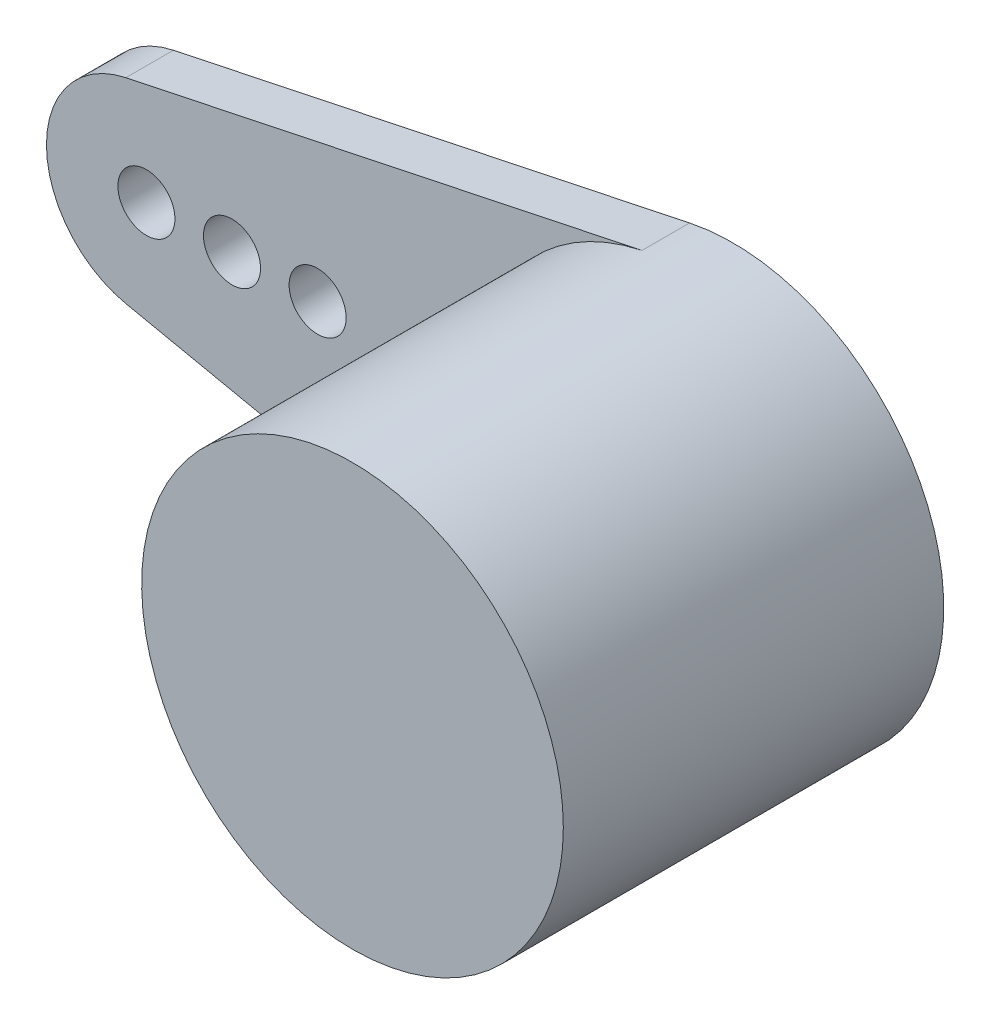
ISO-10303-21;
HEADER;
FILE_DESCRIPTION(('STEP AP214'),'2;1');
FILE_NAME('part.step','',(''),(''),'','','');
FILE_SCHEMA(('AUTOMOTIVE_DESIGN { 1 0 10303 214 1 1 1 1 }'));
ENDSEC;
DATA;
#1=APPLICATION_CONTEXT('core data for automotive mechanical design processes');
#2=APPLICATION_PROTOCOL_DEFINITION('international standard','automotive_design',2000,#1);
#3=PRODUCT_CONTEXT('',#1,'mechanical');
#4=PRODUCT('Part','Part','',(#3));
#5=PRODUCT_RELATED_PRODUCT_CATEGORY('part','',(#4));
#6=PRODUCT_DEFINITION_FORMATION('','',#4);
#7=PRODUCT_DEFINITION_CONTEXT('part definition',#1,'design');
#8=PRODUCT_DEFINITION('design','',#6,#7);
#9=PRODUCT_DEFINITION_SHAPE('','',#8);
#10=(LENGTH_UNIT() NAMED_UNIT(*) SI_UNIT(.MILLI.,.METRE.));
#11=(NAMED_UNIT(*) PLANE_ANGLE_UNIT() SI_UNIT($,.RADIAN.));
#12=(NAMED_UNIT(*) SI_UNIT($,.STERADIAN.) SOLID_ANGLE_UNIT());
#13=UNCERTAINTY_MEASURE_WITH_UNIT(LENGTH_MEASURE(1.E-05),#10,'distance_accuracy_value','');
#14=(GEOMETRIC_REPRESENTATION_CONTEXT(3) GLOBAL_UNCERTAINTY_ASSIGNED_CONTEXT((#13)) GLOBAL_UNIT_ASSIGNED_CONTEXT((#10,
#11,#12)) REPRESENTATION_CONTEXT('',''));
#15=CARTESIAN_POINT('',(0.,0.,0.));
#16=DIRECTION('',(0.,0.,1.));
#17=DIRECTION('',(1.,0.,0.));
#18=AXIS2_PLACEMENT_3D('',#15,#16,#17);
#19=CARTESIAN_POINT('',(0.,0.,12.));
#20=DIRECTION('',(0.,0.,-1.));
#21=DIRECTION('',(-1.,0.,0.));
#22=AXIS2_PLACEMENT_3D('',#19,#20,#21);
#23=CYLINDRICAL_SURFACE('',#22,6.65);
#24=CARTESIAN_POINT('',(0.,0.,12.));
#25=DIRECTION('',(0.,0.,1.));
#26=DIRECTION('',(1.,0.,0.));
#27=AXIS2_PLACEMENT_3D('',#24,#25,#26);
#28=CIRCLE('',#27,6.65);
#29=CARTESIAN_POINT('',(6.65,0.,12.));
#30=VERTEX_POINT('',#29);
#31=EDGE_CURVE('E41',#30,#30,#28,.T.);
#32=ORIENTED_EDGE('',*,*,#31,.F.);
#33=EDGE_LOOP('',(#32));
#34=FACE_BOUND('',#33,.T.);
#35=CARTESIAN_POINT('',(0.,0.,1.5));
#36=DIRECTION('',(0.,0.,-1.));
#37=DIRECTION('',(-1.,0.,0.));
#38=AXIS2_PLACEMENT_3D('',#35,#36,#37);
#39=CIRCLE('',#38,6.65);
#40=CARTESIAN_POINT('',(-1.36769722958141,-6.50783407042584,1.5));
#41=VERTEX_POINT('',#40);
#42=CARTESIAN_POINT('',(-1.36769722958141,6.50783407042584,1.5));
#43=VERTEX_POINT('',#42);
#44=EDGE_CURVE('E11',#41,#43,#39,.T.);
#45=ORIENTED_EDGE('',*,*,#44,.F.);
#46=DIRECTION('',(0.,0.,-1.));
#47=VECTOR('',#46,1.);
#48=CARTESIAN_POINT('',(-1.36769722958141,-6.50783407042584,1.5));
#49=LINE('',#48,#47);
#50=CARTESIAN_POINT('',(-1.36769722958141,-6.50783407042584,0.));
#51=VERTEX_POINT('',#50);
#52=EDGE_CURVE('E83',#41,#51,#49,.T.);
#53=ORIENTED_EDGE('',*,*,#52,.T.);
#54=CARTESIAN_POINT('',(0.,0.,0.));
#55=DIRECTION('',(0.,0.,1.));
#56=DIRECTION('',(1.,0.,0.));
#57=AXIS2_PLACEMENT_3D('',#54,#55,#56);
#58=CIRCLE('',#57,6.65);
#59=CARTESIAN_POINT('',(-1.36769722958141,6.50783407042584,0.));
#60=VERTEX_POINT('',#59);
#61=EDGE_CURVE('E107',#51,#60,#58,.T.);
#62=ORIENTED_EDGE('',*,*,#61,.T.);
#63=DIRECTION('',(0.,0.,-1.));
#64=VECTOR('',#63,1.);
#65=CARTESIAN_POINT('',(-1.36769722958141,6.50783407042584,1.5));
#66=LINE('',#65,#64);
#67=EDGE_CURVE('E48',#43,#60,#66,.T.);
#68=ORIENTED_EDGE('',*,*,#67,.F.);
#69=EDGE_LOOP('',(#45,#53,#62,#68));
#70=FACE_BOUND('',#69,.T.);
#71=ADVANCED_FACE('F34',(#34,#70),#23,.T.);
#72=CARTESIAN_POINT('',(0.,0.,12.));
#73=DIRECTION('',(0.,0.,1.));
#74=DIRECTION('',(1.,0.,0.));
#75=AXIS2_PLACEMENT_3D('',#72,#73,#74);
#76=PLANE('',#75);
#77=ORIENTED_EDGE('',*,*,#31,.T.);
#78=EDGE_LOOP('',(#77));
#79=FACE_BOUND('',#78,.T.);
#80=ADVANCED_FACE('F118',(#79),#76,.T.);
#81=CARTESIAN_POINT('',(0.,0.,0.));
#82=DIRECTION('',(0.,0.,1.));
#83=DIRECTION('',(1.,0.,0.));
#84=AXIS2_PLACEMENT_3D('',#81,#82,#83);
#85=PLANE('',#84);
#86=ORIENTED_EDGE('',*,*,#61,.F.);
#87=DIRECTION('',(-0.97862166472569,0.205668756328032,0.));
#88=VECTOR('',#87,1.);
#89=CARTESIAN_POINT('',(-17.6486033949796,-3.08621175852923,0.));
#90=LINE('',#89,#88);
#91=CARTESIAN_POINT('',(-17.6486033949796,-3.08621175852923,0.));
#92=VERTEX_POINT('',#91);
#93=EDGE_CURVE('E102',#51,#92,#90,.T.);
#94=ORIENTED_EDGE('',*,*,#93,.T.);
#95=CARTESIAN_POINT('',(-17.,0.,0.));
#96=DIRECTION('',(0.,0.,-1.));
#97=DIRECTION('',(-1.,0.,0.));
#98=AXIS2_PLACEMENT_3D('',#95,#96,#97);
#99=CIRCLE('',#98,3.15363114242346);
#100=CARTESIAN_POINT('',(-17.6486033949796,3.08621175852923,0.));
#101=VERTEX_POINT('',#100);
#102=EDGE_CURVE('E77',#92,#101,#99,.T.);
#103=ORIENTED_EDGE('',*,*,#102,.T.);
#104=DIRECTION('',(0.97862166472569,0.205668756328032,0.));
#105=VECTOR('',#104,1.);
#106=CARTESIAN_POINT('',(-1.36769722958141,6.50783407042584,0.));
#107=LINE('',#106,#105);
#108=EDGE_CURVE('E93',#101,#60,#107,.T.);
#109=ORIENTED_EDGE('',*,*,#108,.T.);
#110=EDGE_LOOP('',(#86,#94,#103,#109));
#111=FACE_BOUND('',#110,.T.);
#112=CARTESIAN_POINT('',(-11.6,0.,0.));
#113=DIRECTION('',(0.,0.,-1.));
#114=DIRECTION('',(-1.,0.,0.));
#115=AXIS2_PLACEMENT_3D('',#112,#113,#114);
#116=CIRCLE('',#115,0.9);
#117=CARTESIAN_POINT('',(-12.5,0.,0.));
#118=VERTEX_POINT('',#117);
#119=EDGE_CURVE('E98',#118,#118,#116,.T.);
#120=ORIENTED_EDGE('',*,*,#119,.F.);
#121=EDGE_LOOP('',(#120));
#122=FACE_BOUND('',#121,.T.);
#123=CARTESIAN_POINT('',(-14.3,0.,0.));
#124=DIRECTION('',(0.,0.,-1.));
#125=DIRECTION('',(-1.,0.,0.));
#126=AXIS2_PLACEMENT_3D('',#123,#124,#125);
#127=CIRCLE('',#126,0.9);
#128=CARTESIAN_POINT('',(-15.2,0.,0.));
#129=VERTEX_POINT('',#128);
#130=EDGE_CURVE('E125',#129,#129,#127,.T.);
#131=ORIENTED_EDGE('',*,*,#130,.F.);
#132=EDGE_LOOP('',(#131));
#133=FACE_BOUND('',#132,.T.);
#134=CARTESIAN_POINT('',(-17.,0.,0.));
#135=DIRECTION('',(0.,0.,-1.));
#136=DIRECTION('',(-1.,0.,0.));
#137=AXIS2_PLACEMENT_3D('',#134,#135,#136);
#138=CIRCLE('',#137,0.9);
#139=CARTESIAN_POINT('',(-17.9,0.,0.));
#140=VERTEX_POINT('',#139);
#141=EDGE_CURVE('E128',#140,#140,#138,.T.);
#142=ORIENTED_EDGE('',*,*,#141,.F.);
#143=EDGE_LOOP('',(#142));
#144=FACE_BOUND('',#143,.T.);
#145=ADVANCED_FACE('F115',(#111,#122,#133,#144),#85,.F.);
#146=CARTESIAN_POINT('',(0.,0.,1.5));
#147=DIRECTION('',(0.,0.,-1.));
#148=DIRECTION('',(-1.,0.,0.));
#149=AXIS2_PLACEMENT_3D('',#146,#147,#148);
#150=PLANE('',#149);
#151=CARTESIAN_POINT('',(-11.6,0.,1.5));
#152=DIRECTION('',(0.,0.,-1.));
#153=DIRECTION('',(-1.,0.,0.));
#154=AXIS2_PLACEMENT_3D('',#151,#152,#153);
#155=CIRCLE('',#154,0.9);
#156=CARTESIAN_POINT('',(-12.5,0.,1.5));
#157=VERTEX_POINT('',#156);
#158=EDGE_CURVE('E104',#157,#157,#155,.T.);
#159=ORIENTED_EDGE('',*,*,#158,.T.);
#160=EDGE_LOOP('',(#159));
#161=FACE_BOUND('',#160,.T.);
#162=CARTESIAN_POINT('',(-14.3,0.,1.5));
#163=DIRECTION('',(0.,0.,-1.));
#164=DIRECTION('',(-1.,0.,0.));
#165=AXIS2_PLACEMENT_3D('',#162,#163,#164);
#166=CIRCLE('',#165,0.9);
#167=CARTESIAN_POINT('',(-15.2,0.,1.5));
#168=VERTEX_POINT('',#167);
#169=EDGE_CURVE('E135',#168,#168,#166,.T.);
#170=ORIENTED_EDGE('',*,*,#169,.T.);
#171=EDGE_LOOP('',(#170));
#172=FACE_BOUND('',#171,.T.);
#173=CARTESIAN_POINT('',(-17.,0.,1.5));
#174=DIRECTION('',(0.,0.,-1.));
#175=DIRECTION('',(-1.,0.,0.));
#176=AXIS2_PLACEMENT_3D('',#173,#174,#175);
#177=CIRCLE('',#176,0.9);
#178=CARTESIAN_POINT('',(-17.9,0.,1.5));
#179=VERTEX_POINT('',#178);
#180=EDGE_CURVE('E130',#179,#179,#177,.T.);
#181=ORIENTED_EDGE('',*,*,#180,.T.);
#182=EDGE_LOOP('',(#181));
#183=FACE_BOUND('',#182,.T.);
#184=DIRECTION('',(-0.97862166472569,0.205668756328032,0.));
#185=VECTOR('',#184,1.);
#186=CARTESIAN_POINT('',(-17.6486033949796,-3.08621175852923,1.5));
#187=LINE('',#186,#185);
#188=CARTESIAN_POINT('',(-17.6486033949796,-3.08621175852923,1.5));
#189=VERTEX_POINT('',#188);
#190=EDGE_CURVE('E88',#41,#189,#187,.T.);
#191=ORIENTED_EDGE('',*,*,#190,.F.);
#192=ORIENTED_EDGE('',*,*,#44,.T.);
#193=DIRECTION('',(0.97862166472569,0.205668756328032,0.));
#194=VECTOR('',#193,1.);
#195=CARTESIAN_POINT('',(-1.36769722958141,6.50783407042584,1.5));
#196=LINE('',#195,#194);
#197=CARTESIAN_POINT('',(-17.6486033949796,3.08621175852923,1.5));
#198=VERTEX_POINT('',#197);
#199=EDGE_CURVE('E90',#198,#43,#196,.T.);
#200=ORIENTED_EDGE('',*,*,#199,.F.);
#201=CARTESIAN_POINT('',(-17.,0.,1.5));
#202=DIRECTION('',(0.,0.,-1.));
#203=DIRECTION('',(-1.,0.,0.));
#204=AXIS2_PLACEMENT_3D('',#201,#202,#203);
#205=CIRCLE('',#204,3.15363114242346);
#206=EDGE_CURVE('E74',#189,#198,#205,.T.);
#207=ORIENTED_EDGE('',*,*,#206,.F.);
#208=EDGE_LOOP('',(#191,#192,#200,#207));
#209=FACE_BOUND('',#208,.T.);
#210=ADVANCED_FACE('F87',(#161,#172,#183,#209),#150,.F.);
#211=CARTESIAN_POINT('',(-1.36769722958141,6.50783407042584,1.5));
#212=DIRECTION('',(-0.205668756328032,0.97862166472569,0.));
#213=DIRECTION('',(-0.97862166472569,-0.205668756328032,0.));
#214=AXIS2_PLACEMENT_3D('',#211,#212,#213);
#215=PLANE('',#214);
#216=ORIENTED_EDGE('',*,*,#108,.F.);
#217=DIRECTION('',(0.,0.,-1.));
#218=VECTOR('',#217,1.);
#219=CARTESIAN_POINT('',(-17.6486033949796,3.08621175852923,1.5));
#220=LINE('',#219,#218);
#221=EDGE_CURVE('E82',#198,#101,#220,.T.);
#222=ORIENTED_EDGE('',*,*,#221,.F.);
#223=ORIENTED_EDGE('',*,*,#199,.T.);
#224=ORIENTED_EDGE('',*,*,#67,.T.);
#225=EDGE_LOOP('',(#216,#222,#223,#224));
#226=FACE_BOUND('',#225,.T.);
#227=ADVANCED_FACE('F114',(#226),#215,.T.);
#228=CARTESIAN_POINT('',(-17.,0.,1.5));
#229=DIRECTION('',(0.,0.,-1.));
#230=DIRECTION('',(-1.,0.,0.));
#231=AXIS2_PLACEMENT_3D('',#228,#229,#230);
#232=CYLINDRICAL_SURFACE('',#231,3.15363114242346);
#233=ORIENTED_EDGE('',*,*,#102,.F.);
#234=DIRECTION('',(0.,0.,-1.));
#235=VECTOR('',#234,1.);
#236=CARTESIAN_POINT('',(-17.6486033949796,-3.08621175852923,1.5));
#237=LINE('',#236,#235);
#238=EDGE_CURVE('E71',#189,#92,#237,.T.);
#239=ORIENTED_EDGE('',*,*,#238,.F.);
#240=ORIENTED_EDGE('',*,*,#206,.T.);
#241=ORIENTED_EDGE('',*,*,#221,.T.);
#242=EDGE_LOOP('',(#233,#239,#240,#241));
#243=FACE_BOUND('',#242,.T.);
#244=ADVANCED_FACE('F73',(#243),#232,.T.);
#245=CARTESIAN_POINT('',(-17.6486033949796,-3.08621175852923,1.5));
#246=DIRECTION('',(-0.205668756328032,-0.97862166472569,0.));
#247=DIRECTION('',(0.97862166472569,-0.205668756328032,0.));
#248=AXIS2_PLACEMENT_3D('',#245,#246,#247);
#249=PLANE('',#248);
#250=ORIENTED_EDGE('',*,*,#93,.F.);
#251=ORIENTED_EDGE('',*,*,#52,.F.);
#252=ORIENTED_EDGE('',*,*,#190,.T.);
#253=ORIENTED_EDGE('',*,*,#238,.T.);
#254=EDGE_LOOP('',(#250,#251,#252,#253));
#255=FACE_BOUND('',#254,.T.);
#256=ADVANCED_FACE('F92',(#255),#249,.T.);
#257=CARTESIAN_POINT('',(-11.6,0.,1.5));
#258=DIRECTION('',(0.,0.,-1.));
#259=DIRECTION('',(-1.,0.,0.));
#260=AXIS2_PLACEMENT_3D('',#257,#258,#259);
#261=CYLINDRICAL_SURFACE('',#260,0.9);
#262=ORIENTED_EDGE('',*,*,#158,.F.);
#263=EDGE_LOOP('',(#262));
#264=FACE_BOUND('',#263,.T.);
#265=ORIENTED_EDGE('',*,*,#119,.T.);
#266=EDGE_LOOP('',(#265));
#267=FACE_BOUND('',#266,.T.);
#268=ADVANCED_FACE('F142',(#264,#267),#261,.F.);
#269=CARTESIAN_POINT('',(-14.3,0.,1.5));
#270=DIRECTION('',(0.,0.,-1.));
#271=DIRECTION('',(-1.,0.,0.));
#272=AXIS2_PLACEMENT_3D('',#269,#270,#271);
#273=CYLINDRICAL_SURFACE('',#272,0.9);
#274=ORIENTED_EDGE('',*,*,#169,.F.);
#275=EDGE_LOOP('',(#274));
#276=FACE_BOUND('',#275,.T.);
#277=ORIENTED_EDGE('',*,*,#130,.T.);
#278=EDGE_LOOP('',(#277));
#279=FACE_BOUND('',#278,.T.);
#280=ADVANCED_FACE('F144',(#276,#279),#273,.F.);
#281=CARTESIAN_POINT('',(-17.,0.,1.5));
#282=DIRECTION('',(0.,0.,-1.));
#283=DIRECTION('',(-1.,0.,0.));
#284=AXIS2_PLACEMENT_3D('',#281,#282,#283);
#285=CYLINDRICAL_SURFACE('',#284,0.9);
#286=ORIENTED_EDGE('',*,*,#180,.F.);
#287=EDGE_LOOP('',(#286));
#288=FACE_BOUND('',#287,.T.);
#289=ORIENTED_EDGE('',*,*,#141,.T.);
#290=EDGE_LOOP('',(#289));
#291=FACE_BOUND('',#290,.T.);
#292=ADVANCED_FACE('F151',(#288,#291),#285,.F.);
#293=CLOSED_SHELL('',(#71,#80,#145,#210,#227,#244,#256,#268,#280,#292));
#294=MANIFOLD_SOLID_BREP('B2',#293);
#295=ADVANCED_BREP_SHAPE_REPRESENTATION('',(#18,#294),#14);
#296=SHAPE_DEFINITION_REPRESENTATION(#9,#295);
ENDSEC;
END-ISO-10303-21;
